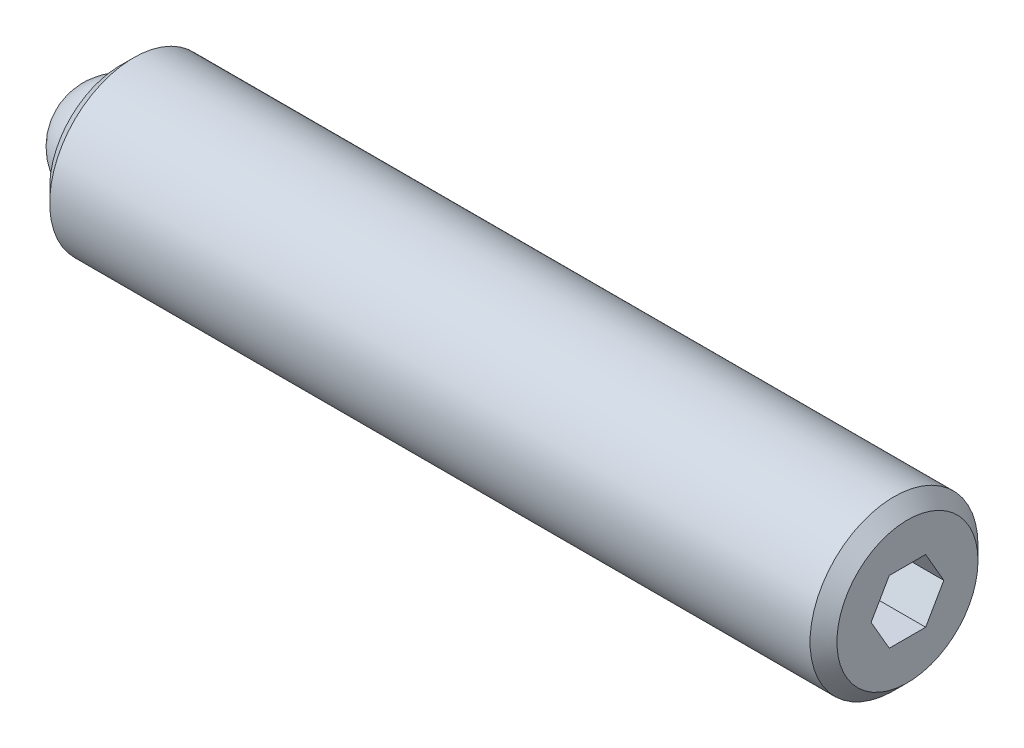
from build123d import *

# Parameters (mm, degrees)
SKETCH2_R           = 3.175
BOSS_EXTRUDE1_DEPTH = 29.765625
CHAMFER1_SIZE       = 0.508
CHAMFER2_SIZE       = 0.508
CUT_EXTRUDE2_DEPTH  = 2.286
SKETCH3_R           = 1.9812
CUT_EXTRUDE3_DEPTH  = 1.984375


with BuildPart() as part:
    # Sketch2 → Boss-Extrude1 (new body)
    with BuildSketch(Plane(origin=(0, 0, 0), x_dir=(0, 0, -1), z_dir=(1, 0, 0))):
        Circle(SKETCH2_R)
    extrude(amount=BOSS_EXTRUDE1_DEPTH)

    # Chamfer1
    chamfer1_edges = [part.edges().sort_by_distance(p)[0] for p in [
        (0, 0, 3.175),
    ]]
    chamfer(chamfer1_edges, length=CHAMFER1_SIZE)

    # Chamfer2
    chamfer2_edges = [part.edges().sort_by_distance(p)[0] for p in [
        (29.765625, 0, 3.175),
    ]]
    chamfer(chamfer2_edges, length=CHAMFER2_SIZE)

    # Sketch4 → Cut-Extrude2 (cut)
    with BuildSketch(Plane(origin=(29.765625, 0, 0), x_dir=(0, 0, -1), z_dir=(1, 0, 0))):
        Polygon((1.374815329, 0), (0.687407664, 1.190625), (-0.687407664, 1.190625), (-1.374815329, 0), (-0.687407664, -1.190625), (0.687407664, -1.190625), align=None)
    extrude(amount=-CUT_EXTRUDE2_DEPTH, mode=Mode.SUBTRACT)

    # Sketch3 → Cut-Extrude3 (cut)
    with BuildSketch(Plane.ZY):
        Circle(SKETCH3_R)
    extrude(amount=-CUT_EXTRUDE3_DEPTH, mode=Mode.SUBTRACT)


with BuildPart() as body_2:
    # Sketch5 → Revolve1 (revolve)
    with BuildSketch(Plane.ZY):
        with BuildLine():
            Line((0, 0), (0, -1.984375))
            ThreePointArc((0, -1.984375), (-1.984375, 0), (0, 1.984375))
            Line((0, 1.984375), (0, 0))
        make_face()
    revolve(axis=Axis((0, 0, 0), (0, 1, 0)))


solid = Compound([part.part, body_2.part])
